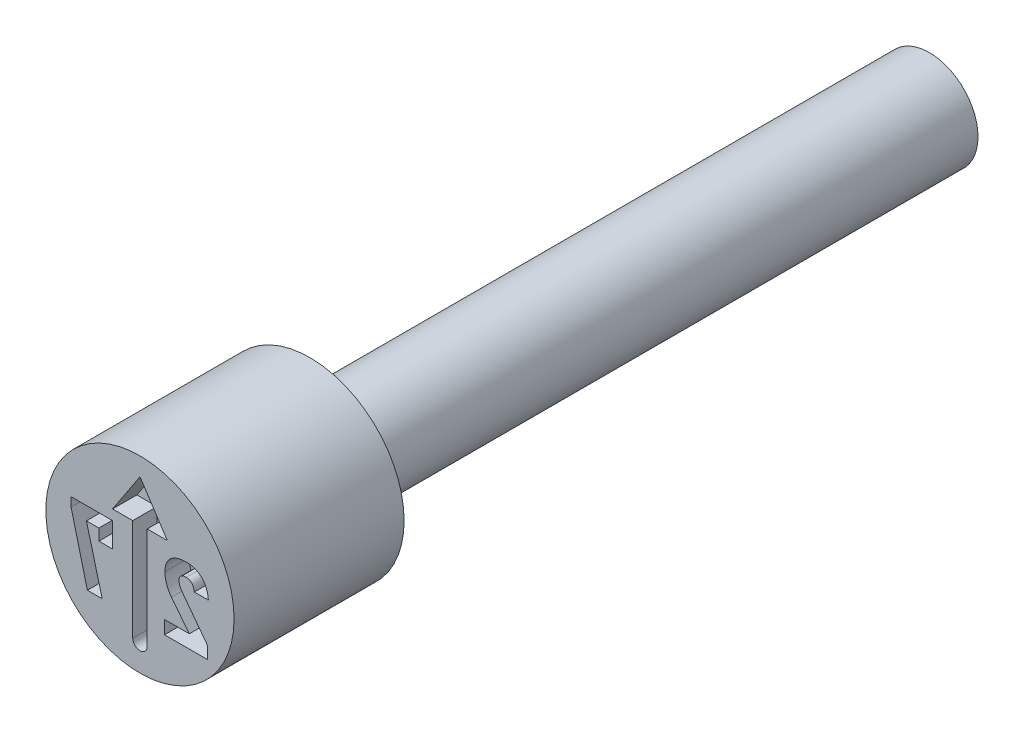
from build123d import *

# Parameters (mm, degrees)
CUT_EXTRUDE4_DEPTH = 0.4
CUT_EXTRUDE5_DEPTH = 0.4


with BuildPart() as part:
    # Sketch2 → Revolve1 (revolve)
    with BuildSketch(Plane(origin=(0, 0, 0), x_dir=(0, 0, -1), z_dir=(1, 0, 0)), mode=Mode.PRIVATE) as revolve1_sk:
        Polygon((0, 1.55), (0, 0), (13, 0), (13, 0.8), (2.8, 0.8), (2.8, 1.55), align=None)
    revolve(revolve1_sk.sketch.rotate(Axis((0, 0, -0.403888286), (0, 0, -1)), 90), axis=Axis((0, 0, -0.403888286), (0, 0, -1)))

    # Sketch3 → Cut-Extrude4 (cut)
    with BuildSketch(Plane.XY):
        with BuildLine():
            Line((0.119045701, 0.566469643), (0.119045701, -1.110101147))
            ThreePointArc((0.119045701, -1.110101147), (0, -1.229146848), (-0.119045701, -1.110101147))
            Line((-0.119045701, -1.110101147), (-0.119045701, 0.566469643))
            Line((-0.119045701, 0.566469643), (-0.451198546, 0.566469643))
            Line((-0.451198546, 0.566469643), (0, 1.251322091))
            Line((0, 1.251322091), (0.451198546, 0.566469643))
            Line((0.451198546, 0.566469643), (0.119045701, 0.566469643))
        make_face()
    extrude(amount=-CUT_EXTRUDE4_DEPTH, mode=Mode.SUBTRACT)

    # Sketch4 → Cut-Extrude5 (cut)
    with BuildSketch(Plane.XY):
        with BuildLine():
            Line((1.11112013, -0.8), (1.11112013, -0.595941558))
            Line((1.11112013, -0.595941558), (0.701055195, -0.052678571))
            add(Edge.make_bspline(
                [(0.701055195, -0.052678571), (0.692466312, -0.040576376), (0.675731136, -0.016995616), (0.660584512, 0.015387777), (0.651148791, 0.040776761), (0.646651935, 0.059188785), (0.643444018, 0.076755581), (0.643049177, 0.088298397), (0.642857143, 0.093912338)],
                knots=[0, 0, 0, 0, 1.664252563, 3.24274559, 3.998498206, 4.704056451, 5.369707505, 6, 6, 6, 6], degree=3))
            Line((0.642857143, 0.093912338), (0.642857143, 0.095616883))
            add(Edge.make_bspline(
                [(0.642857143, 0.095616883), (0.643189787, 0.103289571), (0.64382708, 0.117989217), (0.649831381, 0.138701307), (0.659672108, 0.156738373), (0.673766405, 0.171636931), (0.691312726, 0.183420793), (0.712307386, 0.191725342), (0.736475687, 0.196487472), (0.753630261, 0.19708696), (0.762662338, 0.197402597)],
                knots=[0, 0, 0, 0, 1.029992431, 1.973301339, 2.872554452, 3.768620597, 4.704316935, 5.693697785, 6.785705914, 8, 8, 8, 8], degree=3))
            add(Edge.make_bspline(
                [(0.762662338, 0.197402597), (0.771484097, 0.197058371), (0.788625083, 0.196389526), (0.81289107, 0.188976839), (0.834757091, 0.177349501), (0.853607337, 0.160758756), (0.869216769, 0.139928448), (0.881885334, 0.115399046), (0.890489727, 0.086727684), (0.893533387, 0.066203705), (0.89512987, 0.055438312)],
                knots=[0, 0, 0, 0, 0.980828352, 1.905783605, 2.800718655, 3.724477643, 4.680224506, 5.688112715, 6.78735127, 8, 8, 8, 8], degree=3))
            Line((0.89512987, 0.055438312), (1.125974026, 0.054707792))
            add(Edge.make_bspline(
                [(1.125974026, 0.054707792), (1.124834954, 0.069348), (1.122611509, 0.096499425), (1.115322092, 0.135775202), (1.105900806, 0.172770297), (1.093915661, 0.207477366), (1.078514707, 0.23949454), (1.061211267, 0.26949113), (1.040399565, 0.296539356), (1.01761824, 0.321544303), (0.992243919, 0.343568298), (0.965187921, 0.362996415), (0.936041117, 0.379163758), (0.905246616, 0.392575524), (0.872462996, 0.402754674), (0.838118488, 0.410379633), (0.801818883, 0.414776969), (0.777040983, 0.415311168), (0.764366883, 0.415584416)],
                knots=[0, 0, 0, 0, 1.173229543, 2.290119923, 3.354877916, 4.382703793, 5.372196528, 6.339367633, 7.289741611, 8.236749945, 9.180232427, 10.11040526, 11.033485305, 11.978374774, 12.930610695, 13.916256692, 14.93414813, 16, 16, 16, 16], degree=3))
            add(Edge.make_bspline(
                [(0.764366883, 0.415584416), (0.750719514, 0.415390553), (0.724177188, 0.415013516), (0.685536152, 0.41094352), (0.649179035, 0.404800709), (0.615164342, 0.395814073), (0.583628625, 0.384091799), (0.554477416, 0.369957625), (0.527649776, 0.353291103), (0.503351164, 0.334056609), (0.481488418, 0.312603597), (0.462670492, 0.288714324), (0.446380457, 0.262871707), (0.433646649, 0.234574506), (0.423163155, 0.204488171), (0.416375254, 0.172073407), (0.411801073, 0.13771186), (0.411297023, 0.114058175), (0.411038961, 0.101948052)],
                knots=[0, 0, 0, 0, 1.219700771, 2.37215663, 3.469774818, 4.513610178, 5.512457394, 6.473141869, 7.405450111, 8.330272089, 9.238546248, 10.1372905, 11.043445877, 11.962355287, 12.905558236, 13.886315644, 14.917844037, 16, 16, 16, 16], degree=3))
            add(Edge.make_bspline(
                [(0.411038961, 0.101948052), (0.411349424, 0.087320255), (0.411970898, 0.059988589), (0.4175807, 0.019082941), (0.426620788, -0.021613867), (0.439036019, -0.061905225), (0.454458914, -0.101093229), (0.472969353, -0.138641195), (0.493860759, -0.17456574), (0.510415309, -0.196737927), (0.518668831, -0.207792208)],
                knots=[0, 0, 0, 0, 0.984368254, 1.970475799, 2.971844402, 3.988480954, 5.008197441, 6.005725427, 7.005724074, 8, 8, 8, 8], degree=3))
            Line((0.518668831, -0.207792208), (0.812824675, -0.581818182))
            Line((0.812824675, -0.581818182), (0.404464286, -0.581818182))
            Line((0.404464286, -0.581818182), (0.404464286, -0.8))
            Line((0.404464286, -0.8), (1.11112013, -0.8))
        make_face()
        Polygon((-1.133805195, 0.4), (-1.133805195, 0.249512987), (-0.865948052, -0.8), (-0.621954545, -0.8), (-0.881532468, 0.181818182), (-0.676256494, 0.181818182), (-0.676256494, -0.005194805), (-0.451012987, -0.005194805), (-0.451012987, 0.4), align=None)
    extrude(amount=-CUT_EXTRUDE5_DEPTH, mode=Mode.SUBTRACT)


solid = part.part
